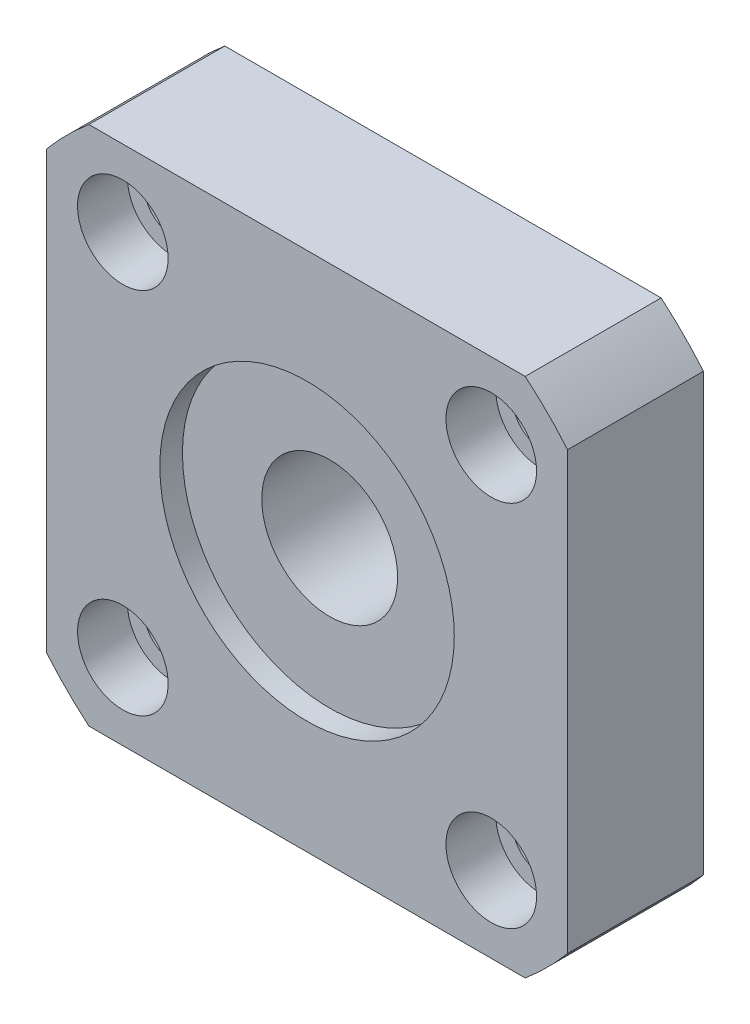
ISO-10303-21;
HEADER;
FILE_DESCRIPTION(('STEP AP214'),'2;1');
FILE_NAME('part.step','',(''),(''),'','','');
FILE_SCHEMA(('AUTOMOTIVE_DESIGN { 1 0 10303 214 1 1 1 1 }'));
ENDSEC;
DATA;
#1=APPLICATION_CONTEXT('core data for automotive mechanical design processes');
#2=APPLICATION_PROTOCOL_DEFINITION('international standard','automotive_design',2000,#1);
#3=PRODUCT_CONTEXT('',#1,'mechanical');
#4=PRODUCT('Part','Part','',(#3));
#5=PRODUCT_RELATED_PRODUCT_CATEGORY('part','',(#4));
#6=PRODUCT_DEFINITION_FORMATION('','',#4);
#7=PRODUCT_DEFINITION_CONTEXT('part definition',#1,'design');
#8=PRODUCT_DEFINITION('design','',#6,#7);
#9=PRODUCT_DEFINITION_SHAPE('','',#8);
#10=(LENGTH_UNIT() NAMED_UNIT(*) SI_UNIT(.MILLI.,.METRE.));
#11=(NAMED_UNIT(*) PLANE_ANGLE_UNIT() SI_UNIT($,.RADIAN.));
#12=(NAMED_UNIT(*) SI_UNIT($,.STERADIAN.) SOLID_ANGLE_UNIT());
#13=UNCERTAINTY_MEASURE_WITH_UNIT(LENGTH_MEASURE(1.E-05),#10,'distance_accuracy_value','');
#14=(GEOMETRIC_REPRESENTATION_CONTEXT(3) GLOBAL_UNCERTAINTY_ASSIGNED_CONTEXT((#13)) GLOBAL_UNIT_ASSIGNED_CONTEXT((#10,
#11,#12)) REPRESENTATION_CONTEXT('',''));
#15=CARTESIAN_POINT('',(0.,0.,0.));
#16=DIRECTION('',(0.,0.,1.));
#17=DIRECTION('',(1.,0.,0.));
#18=AXIS2_PLACEMENT_3D('',#15,#16,#17);
#19=CARTESIAN_POINT('',(0.,0.,12.));
#20=DIRECTION('',(0.,0.,-1.));
#21=DIRECTION('',(-1.,0.,0.));
#22=AXIS2_PLACEMENT_3D('',#19,#20,#21);
#23=CYLINDRICAL_SURFACE('',#22,6.);
#24=CARTESIAN_POINT('',(0.,0.,0.));
#25=DIRECTION('',(0.,0.,1.));
#26=DIRECTION('',(1.,0.,0.));
#27=AXIS2_PLACEMENT_3D('',#24,#25,#26);
#28=CIRCLE('',#27,6.);
#29=CARTESIAN_POINT('',(6.,0.,0.));
#30=VERTEX_POINT('',#29);
#31=EDGE_CURVE('E95',#30,#30,#28,.T.);
#32=ORIENTED_EDGE('',*,*,#31,.F.);
#33=EDGE_LOOP('',(#32));
#34=FACE_BOUND('',#33,.T.);
#35=CARTESIAN_POINT('',(0.,0.,10.));
#36=DIRECTION('',(0.,0.,1.));
#37=DIRECTION('',(1.,0.,0.));
#38=AXIS2_PLACEMENT_3D('',#35,#36,#37);
#39=CIRCLE('',#38,6.);
#40=CARTESIAN_POINT('',(6.,0.,10.));
#41=VERTEX_POINT('',#40);
#42=EDGE_CURVE('E18',#41,#41,#39,.T.);
#43=ORIENTED_EDGE('',*,*,#42,.T.);
#44=EDGE_LOOP('',(#43));
#45=FACE_BOUND('',#44,.T.);
#46=ADVANCED_FACE('F14',(#34,#45),#23,.F.);
#47=CARTESIAN_POINT('',(-16.2634559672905,16.2634559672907,0.));
#48=DIRECTION('',(0.,0.,1.));
#49=DIRECTION('',(1.,0.,0.));
#50=AXIS2_PLACEMENT_3D('',#47,#48,#49);
#51=CYLINDRICAL_SURFACE('',#50,2.5);
#52=CARTESIAN_POINT('',(-16.2634559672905,16.2634559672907,0.));
#53=DIRECTION('',(0.,0.,1.));
#54=DIRECTION('',(0.,1.,0.));
#55=AXIS2_PLACEMENT_3D('',#52,#53,#54);
#56=CIRCLE('',#55,2.5);
#57=CARTESIAN_POINT('',(-16.2634559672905,18.7634559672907,0.));
#58=VERTEX_POINT('',#57);
#59=EDGE_CURVE('E158',#58,#58,#56,.T.);
#60=ORIENTED_EDGE('',*,*,#59,.F.);
#61=EDGE_LOOP('',(#60));
#62=FACE_BOUND('',#61,.T.);
#63=CARTESIAN_POINT('',(-16.2634559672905,16.2634559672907,7.6));
#64=DIRECTION('',(0.,0.,1.));
#65=DIRECTION('',(1.,0.,0.));
#66=AXIS2_PLACEMENT_3D('',#63,#64,#65);
#67=CIRCLE('',#66,2.5);
#68=CARTESIAN_POINT('',(-13.7634559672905,16.2634559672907,7.6));
#69=VERTEX_POINT('',#68);
#70=EDGE_CURVE('E164',#69,#69,#67,.F.);
#71=ORIENTED_EDGE('',*,*,#70,.F.);
#72=EDGE_LOOP('',(#71));
#73=FACE_BOUND('',#72,.T.);
#74=ADVANCED_FACE('F206',(#62,#73),#51,.F.);
#75=CARTESIAN_POINT('',(-16.2634559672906,-16.2634559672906,0.));
#76=DIRECTION('',(0.,0.,1.));
#77=DIRECTION('',(1.,0.,0.));
#78=AXIS2_PLACEMENT_3D('',#75,#76,#77);
#79=CYLINDRICAL_SURFACE('',#78,2.5);
#80=CARTESIAN_POINT('',(-16.2634559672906,-16.2634559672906,0.));
#81=DIRECTION('',(0.,0.,1.));
#82=DIRECTION('',(-1.,0.,0.));
#83=AXIS2_PLACEMENT_3D('',#80,#81,#82);
#84=CIRCLE('',#83,2.5);
#85=CARTESIAN_POINT('',(-18.7634559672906,-16.2634559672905,0.));
#86=VERTEX_POINT('',#85);
#87=EDGE_CURVE('E189',#86,#86,#84,.T.);
#88=ORIENTED_EDGE('',*,*,#87,.F.);
#89=EDGE_LOOP('',(#88));
#90=FACE_BOUND('',#89,.T.);
#91=CARTESIAN_POINT('',(-16.2634559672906,-16.2634559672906,7.6));
#92=DIRECTION('',(0.,0.,1.));
#93=DIRECTION('',(1.,0.,0.));
#94=AXIS2_PLACEMENT_3D('',#91,#92,#93);
#95=CIRCLE('',#94,2.5);
#96=CARTESIAN_POINT('',(-13.7634559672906,-16.2634559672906,7.6));
#97=VERTEX_POINT('',#96);
#98=EDGE_CURVE('E160',#97,#97,#95,.F.);
#99=ORIENTED_EDGE('',*,*,#98,.F.);
#100=EDGE_LOOP('',(#99));
#101=FACE_BOUND('',#100,.T.);
#102=ADVANCED_FACE('F288',(#90,#101),#79,.F.);
#103=CARTESIAN_POINT('',(16.2634559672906,-16.2634559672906,0.));
#104=DIRECTION('',(0.,0.,1.));
#105=DIRECTION('',(1.,0.,0.));
#106=AXIS2_PLACEMENT_3D('',#103,#104,#105);
#107=CYLINDRICAL_SURFACE('',#106,2.5);
#108=CARTESIAN_POINT('',(16.2634559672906,-16.2634559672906,0.));
#109=DIRECTION('',(0.,0.,1.));
#110=DIRECTION('',(0.,-1.,0.));
#111=AXIS2_PLACEMENT_3D('',#108,#109,#110);
#112=CIRCLE('',#111,2.5);
#113=CARTESIAN_POINT('',(16.2634559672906,-18.7634559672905,0.));
#114=VERTEX_POINT('',#113);
#115=EDGE_CURVE('E192',#114,#114,#112,.T.);
#116=ORIENTED_EDGE('',*,*,#115,.F.);
#117=EDGE_LOOP('',(#116));
#118=FACE_BOUND('',#117,.T.);
#119=CARTESIAN_POINT('',(16.2634559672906,-16.2634559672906,7.6));
#120=DIRECTION('',(0.,0.,1.));
#121=DIRECTION('',(1.,0.,0.));
#122=AXIS2_PLACEMENT_3D('',#119,#120,#121);
#123=CIRCLE('',#122,2.5);
#124=CARTESIAN_POINT('',(18.7634559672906,-16.2634559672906,7.6));
#125=VERTEX_POINT('',#124);
#126=EDGE_CURVE('E155',#125,#125,#123,.F.);
#127=ORIENTED_EDGE('',*,*,#126,.F.);
#128=EDGE_LOOP('',(#127));
#129=FACE_BOUND('',#128,.T.);
#130=ADVANCED_FACE('F276',(#118,#129),#107,.F.);
#131=CARTESIAN_POINT('',(16.2634559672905,16.2634559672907,0.));
#132=DIRECTION('',(0.,0.,1.));
#133=DIRECTION('',(1.,0.,0.));
#134=AXIS2_PLACEMENT_3D('',#131,#132,#133);
#135=CYLINDRICAL_SURFACE('',#134,2.5);
#136=CARTESIAN_POINT('',(16.2634559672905,16.2634559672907,0.));
#137=DIRECTION('',(0.,0.,1.));
#138=DIRECTION('',(1.,0.,0.));
#139=AXIS2_PLACEMENT_3D('',#136,#137,#138);
#140=CIRCLE('',#139,2.5);
#141=CARTESIAN_POINT('',(18.7634559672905,16.2634559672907,0.));
#142=VERTEX_POINT('',#141);
#143=EDGE_CURVE('E153',#142,#142,#140,.T.);
#144=ORIENTED_EDGE('',*,*,#143,.F.);
#145=EDGE_LOOP('',(#144));
#146=FACE_BOUND('',#145,.T.);
#147=CARTESIAN_POINT('',(16.2634559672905,16.2634559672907,7.6));
#148=DIRECTION('',(0.,0.,1.));
#149=DIRECTION('',(1.,0.,0.));
#150=AXIS2_PLACEMENT_3D('',#147,#148,#149);
#151=CIRCLE('',#150,2.5);
#152=CARTESIAN_POINT('',(18.7634559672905,16.2634559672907,7.6));
#153=VERTEX_POINT('',#152);
#154=EDGE_CURVE('E150',#153,#153,#151,.F.);
#155=ORIENTED_EDGE('',*,*,#154,.F.);
#156=EDGE_LOOP('',(#155));
#157=FACE_BOUND('',#156,.T.);
#158=ADVANCED_FACE('F225',(#146,#157),#135,.F.);
#159=CARTESIAN_POINT('',(0.,0.,12.));
#160=DIRECTION('',(0.,0.,1.));
#161=DIRECTION('',(1.,0.,0.));
#162=AXIS2_PLACEMENT_3D('',#159,#160,#161);
#163=PLANE('',#162);
#164=CARTESIAN_POINT('',(0.,0.,12.));
#165=DIRECTION('',(0.,0.,1.));
#166=DIRECTION('',(1.,0.,0.));
#167=AXIS2_PLACEMENT_3D('',#164,#165,#166);
#168=CIRCLE('',#167,13.);
#169=CARTESIAN_POINT('',(13.,0.,12.));
#170=VERTEX_POINT('',#169);
#171=EDGE_CURVE('E213',#170,#170,#168,.T.);
#172=ORIENTED_EDGE('',*,*,#171,.F.);
#173=EDGE_LOOP('',(#172));
#174=FACE_BOUND('',#173,.T.);
#175=CARTESIAN_POINT('',(-16.2634559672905,16.2634559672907,12.));
#176=DIRECTION('',(0.,0.,1.));
#177=DIRECTION('',(0.,1.,0.));
#178=AXIS2_PLACEMENT_3D('',#175,#176,#177);
#179=CIRCLE('',#178,4.);
#180=CARTESIAN_POINT('',(-16.2634559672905,20.2634559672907,12.));
#181=VERTEX_POINT('',#180);
#182=EDGE_CURVE('E173',#181,#181,#179,.T.);
#183=ORIENTED_EDGE('',*,*,#182,.F.);
#184=EDGE_LOOP('',(#183));
#185=FACE_BOUND('',#184,.T.);
#186=CARTESIAN_POINT('',(-16.2634559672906,-16.2634559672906,12.));
#187=DIRECTION('',(0.,0.,1.));
#188=DIRECTION('',(-1.,0.,0.));
#189=AXIS2_PLACEMENT_3D('',#186,#187,#188);
#190=CIRCLE('',#189,4.);
#191=CARTESIAN_POINT('',(-20.2634559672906,-16.2634559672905,12.));
#192=VERTEX_POINT('',#191);
#193=EDGE_CURVE('E166',#192,#192,#190,.T.);
#194=ORIENTED_EDGE('',*,*,#193,.F.);
#195=EDGE_LOOP('',(#194));
#196=FACE_BOUND('',#195,.T.);
#197=CARTESIAN_POINT('',(16.2634559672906,-16.2634559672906,12.));
#198=DIRECTION('',(0.,0.,1.));
#199=DIRECTION('',(0.,-1.,0.));
#200=AXIS2_PLACEMENT_3D('',#197,#198,#199);
#201=CIRCLE('',#200,4.);
#202=CARTESIAN_POINT('',(16.2634559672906,-20.2634559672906,12.));
#203=VERTEX_POINT('',#202);
#204=EDGE_CURVE('E162',#203,#203,#201,.T.);
#205=ORIENTED_EDGE('',*,*,#204,.F.);
#206=EDGE_LOOP('',(#205));
#207=FACE_BOUND('',#206,.T.);
#208=CARTESIAN_POINT('',(16.2634559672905,16.2634559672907,12.));
#209=DIRECTION('',(0.,0.,1.));
#210=DIRECTION('',(1.,0.,0.));
#211=AXIS2_PLACEMENT_3D('',#208,#209,#210);
#212=CIRCLE('',#211,4.);
#213=CARTESIAN_POINT('',(20.2634559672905,16.2634559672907,12.));
#214=VERTEX_POINT('',#213);
#215=EDGE_CURVE('E195',#214,#214,#212,.T.);
#216=ORIENTED_EDGE('',*,*,#215,.F.);
#217=EDGE_LOOP('',(#216));
#218=FACE_BOUND('',#217,.T.);
#219=CARTESIAN_POINT('',(0.,0.,12.));
#220=DIRECTION('',(0.,0.,1.));
#221=DIRECTION('',(1.,0.,0.));
#222=AXIS2_PLACEMENT_3D('',#219,#220,#221);
#223=CIRCLE('',#222,30.);
#224=CARTESIAN_POINT('',(23.,19.2613602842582,12.));
#225=VERTEX_POINT('',#224);
#226=CARTESIAN_POINT('',(19.2613602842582,23.,12.));
#227=VERTEX_POINT('',#226);
#228=EDGE_CURVE('E120',#225,#227,#223,.T.);
#229=ORIENTED_EDGE('',*,*,#228,.T.);
#230=DIRECTION('',(-1.,0.,0.));
#231=VECTOR('',#230,1.);
#232=CARTESIAN_POINT('',(19.2613602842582,23.,12.));
#233=LINE('',#232,#231);
#234=CARTESIAN_POINT('',(-19.2613602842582,23.,12.));
#235=VERTEX_POINT('',#234);
#236=EDGE_CURVE('E87',#227,#235,#233,.T.);
#237=ORIENTED_EDGE('',*,*,#236,.T.);
#238=CARTESIAN_POINT('',(0.,0.,12.));
#239=DIRECTION('',(0.,0.,-1.));
#240=DIRECTION('',(-1.,0.,0.));
#241=AXIS2_PLACEMENT_3D('',#238,#239,#240);
#242=CIRCLE('',#241,30.);
#243=CARTESIAN_POINT('',(-23.,19.2613602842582,12.));
#244=VERTEX_POINT('',#243);
#245=EDGE_CURVE('E123',#244,#235,#242,.T.);
#246=ORIENTED_EDGE('',*,*,#245,.F.);
#247=DIRECTION('',(0.,-1.,0.));
#248=VECTOR('',#247,1.);
#249=CARTESIAN_POINT('',(-23.,19.2613602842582,12.));
#250=LINE('',#249,#248);
#251=CARTESIAN_POINT('',(-23.,-19.2613602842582,12.));
#252=VERTEX_POINT('',#251);
#253=EDGE_CURVE('E126',#244,#252,#250,.T.);
#254=ORIENTED_EDGE('',*,*,#253,.T.);
#255=CARTESIAN_POINT('',(0.,0.,12.));
#256=DIRECTION('',(0.,0.,1.));
#257=DIRECTION('',(1.,0.,0.));
#258=AXIS2_PLACEMENT_3D('',#255,#256,#257);
#259=CIRCLE('',#258,30.);
#260=CARTESIAN_POINT('',(-19.2613602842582,-23.,12.));
#261=VERTEX_POINT('',#260);
#262=EDGE_CURVE('E129',#252,#261,#259,.T.);
#263=ORIENTED_EDGE('',*,*,#262,.T.);
#264=DIRECTION('',(-1.,0.,0.));
#265=VECTOR('',#264,1.);
#266=CARTESIAN_POINT('',(19.2613602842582,-23.,12.));
#267=LINE('',#266,#265);
#268=CARTESIAN_POINT('',(19.2613602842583,-23.,12.));
#269=VERTEX_POINT('',#268);
#270=EDGE_CURVE('E132',#269,#261,#267,.T.);
#271=ORIENTED_EDGE('',*,*,#270,.F.);
#272=CARTESIAN_POINT('',(0.,0.,12.));
#273=DIRECTION('',(0.,0.,-1.));
#274=DIRECTION('',(-1.,0.,0.));
#275=AXIS2_PLACEMENT_3D('',#272,#273,#274);
#276=CIRCLE('',#275,30.);
#277=CARTESIAN_POINT('',(23.,-19.2613602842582,12.));
#278=VERTEX_POINT('',#277);
#279=EDGE_CURVE('E135',#278,#269,#276,.T.);
#280=ORIENTED_EDGE('',*,*,#279,.F.);
#281=DIRECTION('',(0.,-1.,0.));
#282=VECTOR('',#281,1.);
#283=CARTESIAN_POINT('',(23.,19.2613602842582,12.));
#284=LINE('',#283,#282);
#285=EDGE_CURVE('E137',#225,#278,#284,.T.);
#286=ORIENTED_EDGE('',*,*,#285,.F.);
#287=EDGE_LOOP('',(#229,#237,#246,#254,#263,#271,#280,#286));
#288=FACE_BOUND('',#287,.T.);
#289=ADVANCED_FACE('F222',(#174,#185,#196,#207,#218,#288),#163,.T.);
#290=CARTESIAN_POINT('',(0.,0.,0.));
#291=DIRECTION('',(0.,0.,1.));
#292=DIRECTION('',(1.,0.,0.));
#293=AXIS2_PLACEMENT_3D('',#290,#291,#292);
#294=PLANE('',#293);
#295=ORIENTED_EDGE('',*,*,#59,.T.);
#296=EDGE_LOOP('',(#295));
#297=FACE_BOUND('',#296,.T.);
#298=ORIENTED_EDGE('',*,*,#87,.T.);
#299=EDGE_LOOP('',(#298));
#300=FACE_BOUND('',#299,.T.);
#301=ORIENTED_EDGE('',*,*,#115,.T.);
#302=EDGE_LOOP('',(#301));
#303=FACE_BOUND('',#302,.T.);
#304=ORIENTED_EDGE('',*,*,#143,.T.);
#305=EDGE_LOOP('',(#304));
#306=FACE_BOUND('',#305,.T.);
#307=CARTESIAN_POINT('',(0.,0.,0.));
#308=DIRECTION('',(0.,0.,1.));
#309=DIRECTION('',(1.,0.,0.));
#310=AXIS2_PLACEMENT_3D('',#307,#308,#309);
#311=CIRCLE('',#310,30.);
#312=CARTESIAN_POINT('',(23.,19.2613602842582,0.));
#313=VERTEX_POINT('',#312);
#314=CARTESIAN_POINT('',(19.2613602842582,23.,0.));
#315=VERTEX_POINT('',#314);
#316=EDGE_CURVE('E91',#313,#315,#311,.T.);
#317=ORIENTED_EDGE('',*,*,#316,.F.);
#318=DIRECTION('',(0.,-1.,0.));
#319=VECTOR('',#318,1.);
#320=CARTESIAN_POINT('',(23.,19.2613602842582,0.));
#321=LINE('',#320,#319);
#322=CARTESIAN_POINT('',(23.,-19.2613602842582,0.));
#323=VERTEX_POINT('',#322);
#324=EDGE_CURVE('E118',#313,#323,#321,.T.);
#325=ORIENTED_EDGE('',*,*,#324,.T.);
#326=CARTESIAN_POINT('',(0.,0.,0.));
#327=DIRECTION('',(0.,0.,-1.));
#328=DIRECTION('',(-1.,0.,0.));
#329=AXIS2_PLACEMENT_3D('',#326,#327,#328);
#330=CIRCLE('',#329,30.);
#331=CARTESIAN_POINT('',(19.2613602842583,-23.,0.));
#332=VERTEX_POINT('',#331);
#333=EDGE_CURVE('E115',#323,#332,#330,.T.);
#334=ORIENTED_EDGE('',*,*,#333,.T.);
#335=DIRECTION('',(-1.,0.,0.));
#336=VECTOR('',#335,1.);
#337=CARTESIAN_POINT('',(19.2613602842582,-23.,0.));
#338=LINE('',#337,#336);
#339=CARTESIAN_POINT('',(-19.2613602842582,-23.,0.));
#340=VERTEX_POINT('',#339);
#341=EDGE_CURVE('E112',#332,#340,#338,.T.);
#342=ORIENTED_EDGE('',*,*,#341,.T.);
#343=CARTESIAN_POINT('',(0.,0.,0.));
#344=DIRECTION('',(0.,0.,1.));
#345=DIRECTION('',(1.,0.,0.));
#346=AXIS2_PLACEMENT_3D('',#343,#344,#345);
#347=CIRCLE('',#346,30.);
#348=CARTESIAN_POINT('',(-23.,-19.2613602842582,0.));
#349=VERTEX_POINT('',#348);
#350=EDGE_CURVE('E109',#349,#340,#347,.T.);
#351=ORIENTED_EDGE('',*,*,#350,.F.);
#352=DIRECTION('',(0.,-1.,0.));
#353=VECTOR('',#352,1.);
#354=CARTESIAN_POINT('',(-23.,19.2613602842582,0.));
#355=LINE('',#354,#353);
#356=CARTESIAN_POINT('',(-23.,19.2613602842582,0.));
#357=VERTEX_POINT('',#356);
#358=EDGE_CURVE('E103',#357,#349,#355,.T.);
#359=ORIENTED_EDGE('',*,*,#358,.F.);
#360=CARTESIAN_POINT('',(0.,0.,0.));
#361=DIRECTION('',(0.,0.,-1.));
#362=DIRECTION('',(-1.,0.,0.));
#363=AXIS2_PLACEMENT_3D('',#360,#361,#362);
#364=CIRCLE('',#363,30.);
#365=CARTESIAN_POINT('',(-19.2613602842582,23.,0.));
#366=VERTEX_POINT('',#365);
#367=EDGE_CURVE('E101',#357,#366,#364,.T.);
#368=ORIENTED_EDGE('',*,*,#367,.T.);
#369=DIRECTION('',(-1.,0.,0.));
#370=VECTOR('',#369,1.);
#371=CARTESIAN_POINT('',(19.2613602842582,23.,0.));
#372=LINE('',#371,#370);
#373=EDGE_CURVE('E84',#315,#366,#372,.T.);
#374=ORIENTED_EDGE('',*,*,#373,.F.);
#375=EDGE_LOOP('',(#317,#325,#334,#342,#351,#359,#368,#374));
#376=FACE_BOUND('',#375,.T.);
#377=ORIENTED_EDGE('',*,*,#31,.T.);
#378=EDGE_LOOP('',(#377));
#379=FACE_BOUND('',#378,.T.);
#380=ADVANCED_FACE('F97',(#297,#300,#303,#306,#376,#379),#294,.F.);
#381=CARTESIAN_POINT('',(0.,0.,12.));
#382=DIRECTION('',(0.,0.,-1.));
#383=DIRECTION('',(-1.,0.,0.));
#384=AXIS2_PLACEMENT_3D('',#381,#382,#383);
#385=CYLINDRICAL_SURFACE('',#384,30.);
#386=DIRECTION('',(0.,0.,-1.));
#387=VECTOR('',#386,1.);
#388=CARTESIAN_POINT('',(19.2613602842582,23.,12.));
#389=LINE('',#388,#387);
#390=EDGE_CURVE('E9',#227,#315,#389,.T.);
#391=ORIENTED_EDGE('',*,*,#390,.F.);
#392=ORIENTED_EDGE('',*,*,#228,.F.);
#393=DIRECTION('',(0.,0.,-1.));
#394=VECTOR('',#393,1.);
#395=CARTESIAN_POINT('',(23.,19.2613602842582,12.));
#396=LINE('',#395,#394);
#397=EDGE_CURVE('E31',#225,#313,#396,.T.);
#398=ORIENTED_EDGE('',*,*,#397,.T.);
#399=ORIENTED_EDGE('',*,*,#316,.T.);
#400=EDGE_LOOP('',(#391,#392,#398,#399));
#401=FACE_BOUND('',#400,.T.);
#402=ADVANCED_FACE('F92',(#401),#385,.T.);
#403=CARTESIAN_POINT('',(19.2613602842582,23.,12.));
#404=DIRECTION('',(0.,-1.,0.));
#405=DIRECTION('',(0.,0.,-1.));
#406=AXIS2_PLACEMENT_3D('',#403,#404,#405);
#407=PLANE('',#406);
#408=DIRECTION('',(0.,0.,-1.));
#409=VECTOR('',#408,1.);
#410=CARTESIAN_POINT('',(-19.2613602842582,23.,12.));
#411=LINE('',#410,#409);
#412=EDGE_CURVE('E23',#235,#366,#411,.T.);
#413=ORIENTED_EDGE('',*,*,#412,.F.);
#414=ORIENTED_EDGE('',*,*,#236,.F.);
#415=ORIENTED_EDGE('',*,*,#390,.T.);
#416=ORIENTED_EDGE('',*,*,#373,.T.);
#417=EDGE_LOOP('',(#413,#414,#415,#416));
#418=FACE_BOUND('',#417,.T.);
#419=ADVANCED_FACE('F16',(#418),#407,.F.);
#420=CARTESIAN_POINT('',(0.,0.,12.));
#421=DIRECTION('',(0.,0.,-1.));
#422=DIRECTION('',(-1.,0.,0.));
#423=AXIS2_PLACEMENT_3D('',#420,#421,#422);
#424=CYLINDRICAL_SURFACE('',#423,30.);
#425=DIRECTION('',(0.,0.,-1.));
#426=VECTOR('',#425,1.);
#427=CARTESIAN_POINT('',(-23.,19.2613602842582,12.));
#428=LINE('',#427,#426);
#429=EDGE_CURVE('E147',#244,#357,#428,.T.);
#430=ORIENTED_EDGE('',*,*,#429,.F.);
#431=ORIENTED_EDGE('',*,*,#245,.T.);
#432=ORIENTED_EDGE('',*,*,#412,.T.);
#433=ORIENTED_EDGE('',*,*,#367,.F.);
#434=EDGE_LOOP('',(#430,#431,#432,#433));
#435=FACE_BOUND('',#434,.T.);
#436=ADVANCED_FACE('F251',(#435),#424,.T.);
#437=CARTESIAN_POINT('',(-23.,19.2613602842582,12.));
#438=DIRECTION('',(1.,0.,0.));
#439=DIRECTION('',(0.,0.,-1.));
#440=AXIS2_PLACEMENT_3D('',#437,#438,#439);
#441=PLANE('',#440);
#442=DIRECTION('',(0.,0.,-1.));
#443=VECTOR('',#442,1.);
#444=CARTESIAN_POINT('',(-23.,-19.2613602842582,12.));
#445=LINE('',#444,#443);
#446=EDGE_CURVE('E145',#252,#349,#445,.T.);
#447=ORIENTED_EDGE('',*,*,#446,.F.);
#448=ORIENTED_EDGE('',*,*,#253,.F.);
#449=ORIENTED_EDGE('',*,*,#429,.T.);
#450=ORIENTED_EDGE('',*,*,#358,.T.);
#451=EDGE_LOOP('',(#447,#448,#449,#450));
#452=FACE_BOUND('',#451,.T.);
#453=ADVANCED_FACE('F249',(#452),#441,.F.);
#454=CARTESIAN_POINT('',(0.,0.,12.));
#455=DIRECTION('',(0.,0.,-1.));
#456=DIRECTION('',(-1.,0.,0.));
#457=AXIS2_PLACEMENT_3D('',#454,#455,#456);
#458=CYLINDRICAL_SURFACE('',#457,30.);
#459=DIRECTION('',(0.,0.,-1.));
#460=VECTOR('',#459,1.);
#461=CARTESIAN_POINT('',(-19.2613602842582,-23.,12.));
#462=LINE('',#461,#460);
#463=EDGE_CURVE('E143',#261,#340,#462,.T.);
#464=ORIENTED_EDGE('',*,*,#463,.F.);
#465=ORIENTED_EDGE('',*,*,#262,.F.);
#466=ORIENTED_EDGE('',*,*,#446,.T.);
#467=ORIENTED_EDGE('',*,*,#350,.T.);
#468=EDGE_LOOP('',(#464,#465,#466,#467));
#469=FACE_BOUND('',#468,.T.);
#470=ADVANCED_FACE('F246',(#469),#458,.T.);
#471=CARTESIAN_POINT('',(19.2613602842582,-23.,12.));
#472=DIRECTION('',(0.,-1.,0.));
#473=DIRECTION('',(0.,0.,-1.));
#474=AXIS2_PLACEMENT_3D('',#471,#472,#473);
#475=PLANE('',#474);
#476=DIRECTION('',(0.,0.,-1.));
#477=VECTOR('',#476,1.);
#478=CARTESIAN_POINT('',(19.2613602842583,-23.,12.));
#479=LINE('',#478,#477);
#480=EDGE_CURVE('E141',#269,#332,#479,.T.);
#481=ORIENTED_EDGE('',*,*,#480,.F.);
#482=ORIENTED_EDGE('',*,*,#270,.T.);
#483=ORIENTED_EDGE('',*,*,#463,.T.);
#484=ORIENTED_EDGE('',*,*,#341,.F.);
#485=EDGE_LOOP('',(#481,#482,#483,#484));
#486=FACE_BOUND('',#485,.T.);
#487=ADVANCED_FACE('F243',(#486),#475,.T.);
#488=CARTESIAN_POINT('',(0.,0.,12.));
#489=DIRECTION('',(0.,0.,-1.));
#490=DIRECTION('',(-1.,0.,0.));
#491=AXIS2_PLACEMENT_3D('',#488,#489,#490);
#492=CYLINDRICAL_SURFACE('',#491,30.);
#493=DIRECTION('',(0.,0.,-1.));
#494=VECTOR('',#493,1.);
#495=CARTESIAN_POINT('',(23.,-19.2613602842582,12.));
#496=LINE('',#495,#494);
#497=EDGE_CURVE('E39',#278,#323,#496,.T.);
#498=ORIENTED_EDGE('',*,*,#497,.F.);
#499=ORIENTED_EDGE('',*,*,#279,.T.);
#500=ORIENTED_EDGE('',*,*,#480,.T.);
#501=ORIENTED_EDGE('',*,*,#333,.F.);
#502=EDGE_LOOP('',(#498,#499,#500,#501));
#503=FACE_BOUND('',#502,.T.);
#504=ADVANCED_FACE('F239',(#503),#492,.T.);
#505=CARTESIAN_POINT('',(23.,19.2613602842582,12.));
#506=DIRECTION('',(1.,0.,0.));
#507=DIRECTION('',(0.,0.,-1.));
#508=AXIS2_PLACEMENT_3D('',#505,#506,#507);
#509=PLANE('',#508);
#510=ORIENTED_EDGE('',*,*,#285,.T.);
#511=ORIENTED_EDGE('',*,*,#497,.T.);
#512=ORIENTED_EDGE('',*,*,#324,.F.);
#513=ORIENTED_EDGE('',*,*,#397,.F.);
#514=EDGE_LOOP('',(#510,#511,#512,#513));
#515=FACE_BOUND('',#514,.T.);
#516=ADVANCED_FACE('F238',(#515),#509,.T.);
#517=CARTESIAN_POINT('',(16.2634559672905,16.2634559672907,7.6));
#518=DIRECTION('',(0.,0.,1.));
#519=DIRECTION('',(1.,0.,0.));
#520=AXIS2_PLACEMENT_3D('',#517,#518,#519);
#521=PLANE('',#520);
#522=CARTESIAN_POINT('',(16.2634559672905,16.2634559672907,7.6));
#523=DIRECTION('',(0.,0.,1.));
#524=DIRECTION('',(1.,0.,0.));
#525=AXIS2_PLACEMENT_3D('',#522,#523,#524);
#526=CIRCLE('',#525,4.);
#527=CARTESIAN_POINT('',(20.2634559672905,16.2634559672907,7.6));
#528=VERTEX_POINT('',#527);
#529=EDGE_CURVE('E154',#528,#528,#526,.T.);
#530=ORIENTED_EDGE('',*,*,#529,.T.);
#531=EDGE_LOOP('',(#530));
#532=FACE_BOUND('',#531,.T.);
#533=ORIENTED_EDGE('',*,*,#154,.T.);
#534=EDGE_LOOP('',(#533));
#535=FACE_BOUND('',#534,.T.);
#536=ADVANCED_FACE('F268',(#532,#535),#521,.T.);
#537=CARTESIAN_POINT('',(16.2634559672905,16.2634559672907,7.6));
#538=DIRECTION('',(0.,0.,1.));
#539=DIRECTION('',(1.,0.,0.));
#540=AXIS2_PLACEMENT_3D('',#537,#538,#539);
#541=CYLINDRICAL_SURFACE('',#540,4.);
#542=ORIENTED_EDGE('',*,*,#529,.F.);
#543=EDGE_LOOP('',(#542));
#544=FACE_BOUND('',#543,.T.);
#545=ORIENTED_EDGE('',*,*,#215,.T.);
#546=EDGE_LOOP('',(#545));
#547=FACE_BOUND('',#546,.T.);
#548=ADVANCED_FACE('F278',(#544,#547),#541,.F.);
#549=CARTESIAN_POINT('',(16.2634559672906,-16.2634559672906,7.6));
#550=DIRECTION('',(0.,0.,1.));
#551=DIRECTION('',(0.,-1.,0.));
#552=AXIS2_PLACEMENT_3D('',#549,#550,#551);
#553=PLANE('',#552);
#554=CARTESIAN_POINT('',(16.2634559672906,-16.2634559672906,7.6));
#555=DIRECTION('',(0.,0.,1.));
#556=DIRECTION('',(0.,-1.,0.));
#557=AXIS2_PLACEMENT_3D('',#554,#555,#556);
#558=CIRCLE('',#557,4.);
#559=CARTESIAN_POINT('',(16.2634559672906,-20.2634559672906,7.6));
#560=VERTEX_POINT('',#559);
#561=EDGE_CURVE('E159',#560,#560,#558,.T.);
#562=ORIENTED_EDGE('',*,*,#561,.T.);
#563=EDGE_LOOP('',(#562));
#564=FACE_BOUND('',#563,.T.);
#565=ORIENTED_EDGE('',*,*,#126,.T.);
#566=EDGE_LOOP('',(#565));
#567=FACE_BOUND('',#566,.T.);
#568=ADVANCED_FACE('F281',(#564,#567),#553,.T.);
#569=CARTESIAN_POINT('',(16.2634559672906,-16.2634559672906,7.6));
#570=DIRECTION('',(0.,0.,1.));
#571=DIRECTION('',(1.,0.,0.));
#572=AXIS2_PLACEMENT_3D('',#569,#570,#571);
#573=CYLINDRICAL_SURFACE('',#572,4.);
#574=ORIENTED_EDGE('',*,*,#561,.F.);
#575=EDGE_LOOP('',(#574));
#576=FACE_BOUND('',#575,.T.);
#577=ORIENTED_EDGE('',*,*,#204,.T.);
#578=EDGE_LOOP('',(#577));
#579=FACE_BOUND('',#578,.T.);
#580=ADVANCED_FACE('F296',(#576,#579),#573,.F.);
#581=CARTESIAN_POINT('',(-16.2634559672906,-16.2634559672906,7.6));
#582=DIRECTION('',(0.,0.,1.));
#583=DIRECTION('',(-1.,0.,0.));
#584=AXIS2_PLACEMENT_3D('',#581,#582,#583);
#585=PLANE('',#584);
#586=CARTESIAN_POINT('',(-16.2634559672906,-16.2634559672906,7.6));
#587=DIRECTION('',(0.,0.,1.));
#588=DIRECTION('',(-1.,0.,0.));
#589=AXIS2_PLACEMENT_3D('',#586,#587,#588);
#590=CIRCLE('',#589,4.);
#591=CARTESIAN_POINT('',(-20.2634559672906,-16.2634559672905,7.6));
#592=VERTEX_POINT('',#591);
#593=EDGE_CURVE('E163',#592,#592,#590,.T.);
#594=ORIENTED_EDGE('',*,*,#593,.T.);
#595=EDGE_LOOP('',(#594));
#596=FACE_BOUND('',#595,.T.);
#597=ORIENTED_EDGE('',*,*,#98,.T.);
#598=EDGE_LOOP('',(#597));
#599=FACE_BOUND('',#598,.T.);
#600=ADVANCED_FACE('F299',(#596,#599),#585,.T.);
#601=CARTESIAN_POINT('',(-16.2634559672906,-16.2634559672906,7.6));
#602=DIRECTION('',(0.,0.,1.));
#603=DIRECTION('',(1.,0.,0.));
#604=AXIS2_PLACEMENT_3D('',#601,#602,#603);
#605=CYLINDRICAL_SURFACE('',#604,4.);
#606=ORIENTED_EDGE('',*,*,#593,.F.);
#607=EDGE_LOOP('',(#606));
#608=FACE_BOUND('',#607,.T.);
#609=ORIENTED_EDGE('',*,*,#193,.T.);
#610=EDGE_LOOP('',(#609));
#611=FACE_BOUND('',#610,.T.);
#612=ADVANCED_FACE('F304',(#608,#611),#605,.F.);
#613=CARTESIAN_POINT('',(-16.2634559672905,16.2634559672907,7.6));
#614=DIRECTION('',(0.,0.,1.));
#615=DIRECTION('',(0.,1.,0.));
#616=AXIS2_PLACEMENT_3D('',#613,#614,#615);
#617=PLANE('',#616);
#618=CARTESIAN_POINT('',(-16.2634559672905,16.2634559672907,7.6));
#619=DIRECTION('',(0.,0.,1.));
#620=DIRECTION('',(0.,1.,0.));
#621=AXIS2_PLACEMENT_3D('',#618,#619,#620);
#622=CIRCLE('',#621,4.);
#623=CARTESIAN_POINT('',(-16.2634559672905,20.2634559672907,7.6));
#624=VERTEX_POINT('',#623);
#625=EDGE_CURVE('E167',#624,#624,#622,.T.);
#626=ORIENTED_EDGE('',*,*,#625,.T.);
#627=EDGE_LOOP('',(#626));
#628=FACE_BOUND('',#627,.T.);
#629=ORIENTED_EDGE('',*,*,#70,.T.);
#630=EDGE_LOOP('',(#629));
#631=FACE_BOUND('',#630,.T.);
#632=ADVANCED_FACE('F307',(#628,#631),#617,.T.);
#633=CARTESIAN_POINT('',(-16.2634559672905,16.2634559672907,7.6));
#634=DIRECTION('',(0.,0.,1.));
#635=DIRECTION('',(1.,0.,0.));
#636=AXIS2_PLACEMENT_3D('',#633,#634,#635);
#637=CYLINDRICAL_SURFACE('',#636,4.);
#638=ORIENTED_EDGE('',*,*,#625,.F.);
#639=EDGE_LOOP('',(#638));
#640=FACE_BOUND('',#639,.T.);
#641=ORIENTED_EDGE('',*,*,#182,.T.);
#642=EDGE_LOOP('',(#641));
#643=FACE_BOUND('',#642,.T.);
#644=ADVANCED_FACE('F312',(#640,#643),#637,.F.);
#645=CARTESIAN_POINT('',(0.,0.,10.));
#646=DIRECTION('',(0.,0.,1.));
#647=DIRECTION('',(1.,0.,0.));
#648=AXIS2_PLACEMENT_3D('',#645,#646,#647);
#649=CYLINDRICAL_SURFACE('',#648,13.);
#650=CARTESIAN_POINT('',(0.,0.,10.));
#651=DIRECTION('',(0.,0.,1.));
#652=DIRECTION('',(1.,0.,0.));
#653=AXIS2_PLACEMENT_3D('',#650,#651,#652);
#654=CIRCLE('',#653,13.);
#655=CARTESIAN_POINT('',(13.,0.,10.));
#656=VERTEX_POINT('',#655);
#657=EDGE_CURVE('E211',#656,#656,#654,.T.);
#658=ORIENTED_EDGE('',*,*,#657,.F.);
#659=EDGE_LOOP('',(#658));
#660=FACE_BOUND('',#659,.T.);
#661=ORIENTED_EDGE('',*,*,#171,.T.);
#662=EDGE_LOOP('',(#661));
#663=FACE_BOUND('',#662,.T.);
#664=ADVANCED_FACE('F220',(#660,#663),#649,.F.);
#665=CARTESIAN_POINT('',(0.,0.,10.));
#666=DIRECTION('',(0.,0.,1.));
#667=DIRECTION('',(1.,0.,0.));
#668=AXIS2_PLACEMENT_3D('',#665,#666,#667);
#669=PLANE('',#668);
#670=ORIENTED_EDGE('',*,*,#42,.F.);
#671=EDGE_LOOP('',(#670));
#672=FACE_BOUND('',#671,.T.);
#673=ORIENTED_EDGE('',*,*,#657,.T.);
#674=EDGE_LOOP('',(#673));
#675=FACE_BOUND('',#674,.T.);
#676=ADVANCED_FACE('F316',(#672,#675),#669,.T.);
#677=CLOSED_SHELL('',(#46,#74,#102,#130,#158,#289,#380,#402,#419,#436,#453,#470,#487,#504,#516,
#536,#548,#568,#580,#600,#612,#632,#644,#664,#676));
#678=MANIFOLD_SOLID_BREP('B1',#677);
#679=ADVANCED_BREP_SHAPE_REPRESENTATION('',(#18,#678),#14);
#680=SHAPE_DEFINITION_REPRESENTATION(#9,#679);
ENDSEC;
END-ISO-10303-21;
